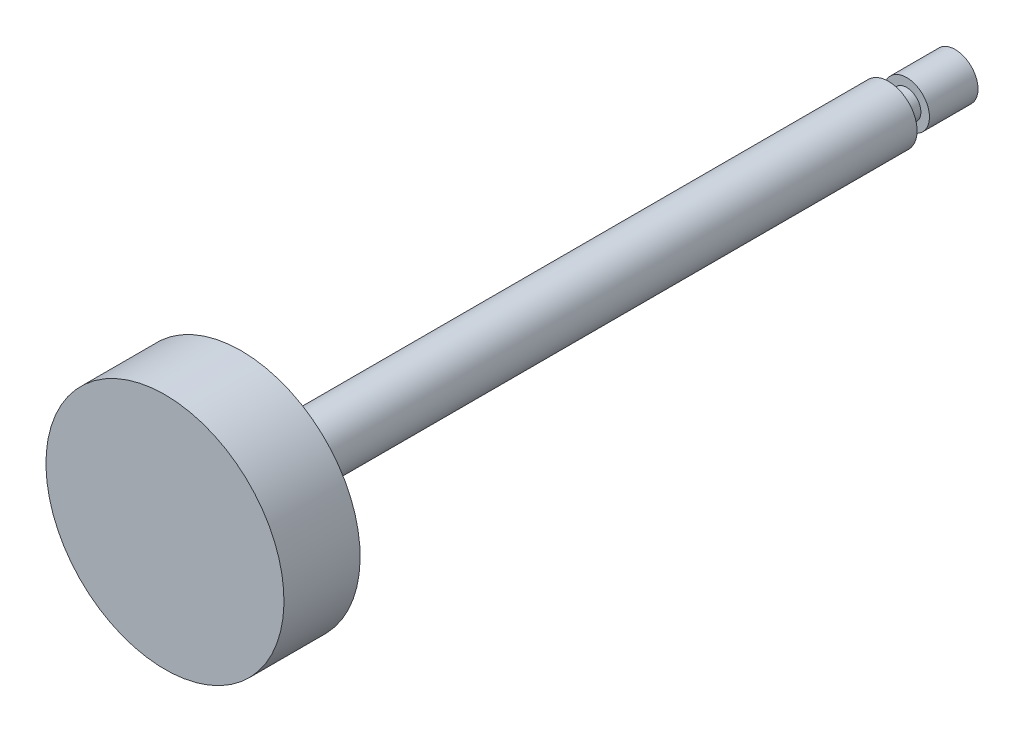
ISO-10303-21;
HEADER;
FILE_DESCRIPTION(('STEP AP214'),'2;1');
FILE_NAME('part.step','',(''),(''),'','','');
FILE_SCHEMA(('AUTOMOTIVE_DESIGN { 1 0 10303 214 1 1 1 1 }'));
ENDSEC;
DATA;
#1=APPLICATION_CONTEXT('core data for automotive mechanical design processes');
#2=APPLICATION_PROTOCOL_DEFINITION('international standard','automotive_design',2000,#1);
#3=PRODUCT_CONTEXT('',#1,'mechanical');
#4=PRODUCT('Part','Part','',(#3));
#5=PRODUCT_RELATED_PRODUCT_CATEGORY('part','',(#4));
#6=PRODUCT_DEFINITION_FORMATION('','',#4);
#7=PRODUCT_DEFINITION_CONTEXT('part definition',#1,'design');
#8=PRODUCT_DEFINITION('design','',#6,#7);
#9=PRODUCT_DEFINITION_SHAPE('','',#8);
#10=(LENGTH_UNIT() NAMED_UNIT(*) SI_UNIT(.MILLI.,.METRE.));
#11=(NAMED_UNIT(*) PLANE_ANGLE_UNIT() SI_UNIT($,.RADIAN.));
#12=(NAMED_UNIT(*) SI_UNIT($,.STERADIAN.) SOLID_ANGLE_UNIT());
#13=UNCERTAINTY_MEASURE_WITH_UNIT(LENGTH_MEASURE(1.E-05),#10,'distance_accuracy_value','');
#14=(GEOMETRIC_REPRESENTATION_CONTEXT(3) GLOBAL_UNCERTAINTY_ASSIGNED_CONTEXT((#13)) GLOBAL_UNIT_ASSIGNED_CONTEXT((#10,
#11,#12)) REPRESENTATION_CONTEXT('',''));
#15=CARTESIAN_POINT('',(0.,0.,0.));
#16=DIRECTION('',(0.,0.,1.));
#17=DIRECTION('',(1.,0.,0.));
#18=AXIS2_PLACEMENT_3D('',#15,#16,#17);
#19=CARTESIAN_POINT('',(0.,-3.,7.));
#20=DIRECTION('',(0.,0.,-1.));
#21=DIRECTION('',(0.,-1.,0.));
#22=AXIS2_PLACEMENT_3D('',#19,#20,#21);
#23=PLANE('',#22);
#24=CARTESIAN_POINT('',(0.,0.,7.));
#25=DIRECTION('',(0.,0.,1.));
#26=DIRECTION('',(0.,1.,0.));
#27=AXIS2_PLACEMENT_3D('',#24,#25,#26);
#28=CIRCLE('',#27,1.5);
#29=CARTESIAN_POINT('',(0.,1.5,7.));
#30=VERTEX_POINT('',#29);
#31=EDGE_CURVE('E40',#30,#30,#28,.T.);
#32=ORIENTED_EDGE('',*,*,#31,.T.);
#33=EDGE_LOOP('',(#32));
#34=FACE_BOUND('',#33,.T.);
#35=CARTESIAN_POINT('',(0.,0.,7.));
#36=DIRECTION('',(0.,0.,1.));
#37=DIRECTION('',(0.,1.,0.));
#38=AXIS2_PLACEMENT_3D('',#35,#36,#37);
#39=CIRCLE('',#38,3.);
#40=CARTESIAN_POINT('',(0.,3.,7.));
#41=VERTEX_POINT('',#40);
#42=EDGE_CURVE('E8',#41,#41,#39,.T.);
#43=ORIENTED_EDGE('',*,*,#42,.F.);
#44=EDGE_LOOP('',(#43));
#45=FACE_BOUND('',#44,.T.);
#46=ADVANCED_FACE('F12',(#34,#45),#23,.T.);
#47=CARTESIAN_POINT('',(0.,0.,83.));
#48=DIRECTION('',(0.,0.,1.));
#49=DIRECTION('',(0.,1.,0.));
#50=AXIS2_PLACEMENT_3D('',#47,#48,#49);
#51=CYLINDRICAL_SURFACE('',#50,3.);
#52=CARTESIAN_POINT('',(0.,0.,75.));
#53=DIRECTION('',(0.,0.,1.));
#54=DIRECTION('',(0.,1.,0.));
#55=AXIS2_PLACEMENT_3D('',#52,#53,#54);
#56=CIRCLE('',#55,3.);
#57=CARTESIAN_POINT('',(0.,3.,75.));
#58=VERTEX_POINT('',#57);
#59=EDGE_CURVE('E18',#58,#58,#56,.T.);
#60=ORIENTED_EDGE('',*,*,#59,.F.);
#61=EDGE_LOOP('',(#60));
#62=FACE_BOUND('',#61,.T.);
#63=ORIENTED_EDGE('',*,*,#42,.T.);
#64=EDGE_LOOP('',(#63));
#65=FACE_BOUND('',#64,.T.);
#66=ADVANCED_FACE('F59',(#62,#65),#51,.T.);
#67=CARTESIAN_POINT('',(0.,-12.5,75.));
#68=DIRECTION('',(0.,0.,-1.));
#69=DIRECTION('',(0.,-1.,0.));
#70=AXIS2_PLACEMENT_3D('',#67,#68,#69);
#71=PLANE('',#70);
#72=ORIENTED_EDGE('',*,*,#59,.T.);
#73=EDGE_LOOP('',(#72));
#74=FACE_BOUND('',#73,.T.);
#75=CARTESIAN_POINT('',(0.,0.,75.));
#76=DIRECTION('',(0.,0.,1.));
#77=DIRECTION('',(0.,1.,0.));
#78=AXIS2_PLACEMENT_3D('',#75,#76,#77);
#79=CIRCLE('',#78,12.5);
#80=CARTESIAN_POINT('',(0.,12.5,75.));
#81=VERTEX_POINT('',#80);
#82=EDGE_CURVE('E22',#81,#81,#79,.T.);
#83=ORIENTED_EDGE('',*,*,#82,.F.);
#84=EDGE_LOOP('',(#83));
#85=FACE_BOUND('',#84,.T.);
#86=ADVANCED_FACE('F63',(#74,#85),#71,.T.);
#87=CARTESIAN_POINT('',(0.,0.,83.));
#88=DIRECTION('',(0.,0.,1.));
#89=DIRECTION('',(0.,1.,0.));
#90=AXIS2_PLACEMENT_3D('',#87,#88,#89);
#91=CYLINDRICAL_SURFACE('',#90,12.5);
#92=CARTESIAN_POINT('',(0.,0.,83.));
#93=DIRECTION('',(0.,0.,1.));
#94=DIRECTION('',(0.,1.,0.));
#95=AXIS2_PLACEMENT_3D('',#92,#93,#94);
#96=CIRCLE('',#95,12.5);
#97=CARTESIAN_POINT('',(0.,12.5,83.));
#98=VERTEX_POINT('',#97);
#99=EDGE_CURVE('E26',#98,#98,#96,.T.);
#100=ORIENTED_EDGE('',*,*,#99,.F.);
#101=EDGE_LOOP('',(#100));
#102=FACE_BOUND('',#101,.T.);
#103=ORIENTED_EDGE('',*,*,#82,.T.);
#104=EDGE_LOOP('',(#103));
#105=FACE_BOUND('',#104,.T.);
#106=ADVANCED_FACE('F68',(#102,#105),#91,.T.);
#107=CARTESIAN_POINT('',(0.,-12.5,83.));
#108=DIRECTION('',(0.,0.,-1.));
#109=DIRECTION('',(0.,-1.,0.));
#110=AXIS2_PLACEMENT_3D('',#107,#108,#109);
#111=PLANE('',#110);
#112=ORIENTED_EDGE('',*,*,#99,.T.);
#113=EDGE_LOOP('',(#112));
#114=FACE_BOUND('',#113,.T.);
#115=ADVANCED_FACE('F73',(#114),#111,.F.);
#116=CARTESIAN_POINT('',(0.,-2.4,0.));
#117=DIRECTION('',(0.,0.,-1.));
#118=DIRECTION('',(0.,-1.,0.));
#119=AXIS2_PLACEMENT_3D('',#116,#117,#118);
#120=PLANE('',#119);
#121=CARTESIAN_POINT('',(0.,0.,0.));
#122=DIRECTION('',(0.,0.,1.));
#123=DIRECTION('',(0.,1.,0.));
#124=AXIS2_PLACEMENT_3D('',#121,#122,#123);
#125=CIRCLE('',#124,2.4);
#126=CARTESIAN_POINT('',(0.,2.4,0.));
#127=VERTEX_POINT('',#126);
#128=EDGE_CURVE('E31',#127,#127,#125,.T.);
#129=ORIENTED_EDGE('',*,*,#128,.F.);
#130=EDGE_LOOP('',(#129));
#131=FACE_BOUND('',#130,.T.);
#132=ADVANCED_FACE('F77',(#131),#120,.T.);
#133=CARTESIAN_POINT('',(0.,0.,83.));
#134=DIRECTION('',(0.,0.,1.));
#135=DIRECTION('',(0.,1.,0.));
#136=AXIS2_PLACEMENT_3D('',#133,#134,#135);
#137=CYLINDRICAL_SURFACE('',#136,2.4);
#138=ORIENTED_EDGE('',*,*,#128,.T.);
#139=EDGE_LOOP('',(#138));
#140=FACE_BOUND('',#139,.T.);
#141=CARTESIAN_POINT('',(0.,0.,5.1));
#142=DIRECTION('',(0.,0.,1.));
#143=DIRECTION('',(0.,1.,0.));
#144=AXIS2_PLACEMENT_3D('',#141,#142,#143);
#145=CIRCLE('',#144,2.4);
#146=CARTESIAN_POINT('',(0.,2.4,5.1));
#147=VERTEX_POINT('',#146);
#148=EDGE_CURVE('E34',#147,#147,#145,.T.);
#149=ORIENTED_EDGE('',*,*,#148,.F.);
#150=EDGE_LOOP('',(#149));
#151=FACE_BOUND('',#150,.T.);
#152=ADVANCED_FACE('F55',(#140,#151),#137,.T.);
#153=CARTESIAN_POINT('',(0.,-1.5,5.1));
#154=DIRECTION('',(0.,0.,1.));
#155=DIRECTION('',(0.,1.,0.));
#156=AXIS2_PLACEMENT_3D('',#153,#154,#155);
#157=PLANE('',#156);
#158=ORIENTED_EDGE('',*,*,#148,.T.);
#159=EDGE_LOOP('',(#158));
#160=FACE_BOUND('',#159,.T.);
#161=CARTESIAN_POINT('',(0.,0.,5.1));
#162=DIRECTION('',(0.,0.,1.));
#163=DIRECTION('',(0.,1.,0.));
#164=AXIS2_PLACEMENT_3D('',#161,#162,#163);
#165=CIRCLE('',#164,1.5);
#166=CARTESIAN_POINT('',(0.,1.5,5.1));
#167=VERTEX_POINT('',#166);
#168=EDGE_CURVE('E37',#167,#167,#165,.T.);
#169=ORIENTED_EDGE('',*,*,#168,.F.);
#170=EDGE_LOOP('',(#169));
#171=FACE_BOUND('',#170,.T.);
#172=ADVANCED_FACE('F48',(#160,#171),#157,.T.);
#173=CARTESIAN_POINT('',(0.,0.,83.));
#174=DIRECTION('',(0.,0.,1.));
#175=DIRECTION('',(0.,1.,0.));
#176=AXIS2_PLACEMENT_3D('',#173,#174,#175);
#177=CYLINDRICAL_SURFACE('',#176,1.5);
#178=ORIENTED_EDGE('',*,*,#168,.T.);
#179=EDGE_LOOP('',(#178));
#180=FACE_BOUND('',#179,.T.);
#181=ORIENTED_EDGE('',*,*,#31,.F.);
#182=EDGE_LOOP('',(#181));
#183=FACE_BOUND('',#182,.T.);
#184=ADVANCED_FACE('F46',(#180,#183),#177,.T.);
#185=CLOSED_SHELL('',(#46,#66,#86,#106,#115,#132,#152,#172,#184));
#186=MANIFOLD_SOLID_BREP('B1',#185);
#187=ADVANCED_BREP_SHAPE_REPRESENTATION('',(#18,#186),#14);
#188=SHAPE_DEFINITION_REPRESENTATION(#9,#187);
ENDSEC;
END-ISO-10303-21;
